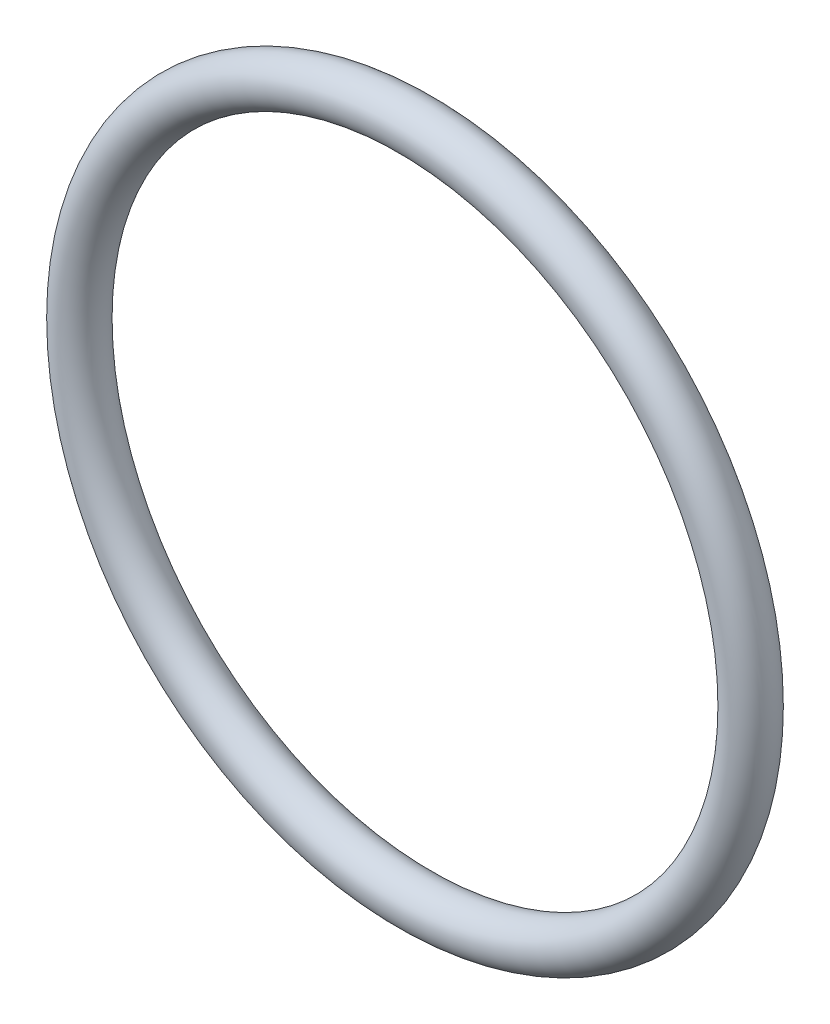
ISO-10303-21;
HEADER;
FILE_DESCRIPTION(('STEP AP214'),'2;1');
FILE_NAME('part.step','',(''),(''),'','','');
FILE_SCHEMA(('AUTOMOTIVE_DESIGN { 1 0 10303 214 1 1 1 1 }'));
ENDSEC;
DATA;
#1=APPLICATION_CONTEXT('core data for automotive mechanical design processes');
#2=APPLICATION_PROTOCOL_DEFINITION('international standard','automotive_design',2000,#1);
#3=PRODUCT_CONTEXT('',#1,'mechanical');
#4=PRODUCT('Part','Part','',(#3));
#5=PRODUCT_RELATED_PRODUCT_CATEGORY('part','',(#4));
#6=PRODUCT_DEFINITION_FORMATION('','',#4);
#7=PRODUCT_DEFINITION_CONTEXT('part definition',#1,'design');
#8=PRODUCT_DEFINITION('design','',#6,#7);
#9=PRODUCT_DEFINITION_SHAPE('','',#8);
#10=(LENGTH_UNIT() NAMED_UNIT(*) SI_UNIT(.MILLI.,.METRE.));
#11=(NAMED_UNIT(*) PLANE_ANGLE_UNIT() SI_UNIT($,.RADIAN.));
#12=(NAMED_UNIT(*) SI_UNIT($,.STERADIAN.) SOLID_ANGLE_UNIT());
#13=UNCERTAINTY_MEASURE_WITH_UNIT(LENGTH_MEASURE(1.E-05),#10,'distance_accuracy_value','');
#14=(GEOMETRIC_REPRESENTATION_CONTEXT(3) GLOBAL_UNCERTAINTY_ASSIGNED_CONTEXT((#13)) GLOBAL_UNIT_ASSIGNED_CONTEXT((#10,
#11,#12)) REPRESENTATION_CONTEXT('',''));
#15=CARTESIAN_POINT('',(0.,0.,0.));
#16=DIRECTION('',(0.,0.,1.));
#17=DIRECTION('',(1.,0.,0.));
#18=AXIS2_PLACEMENT_3D('',#15,#16,#17);
#19=CARTESIAN_POINT('',(0.,0.,0.));
#20=DIRECTION('',(0.,0.,1.));
#21=DIRECTION('',(1.,0.,0.));
#22=AXIS2_PLACEMENT_3D('',#19,#20,#21);
#23=TOROIDAL_SURFACE('',#22,14.5,1.);
#24=CARTESIAN_POINT('',(15.5,0.,0.));
#25=VERTEX_POINT('',#24);
#26=VERTEX_LOOP('',#25);
#27=FACE_BOUND('',#26,.T.);
#28=ADVANCED_FACE('F28',(#27),#23,.T.);
#29=CLOSED_SHELL('',(#28));
#30=MANIFOLD_SOLID_BREP('B2',#29);
#31=ADVANCED_BREP_SHAPE_REPRESENTATION('',(#18,#30),#14);
#32=SHAPE_DEFINITION_REPRESENTATION(#9,#31);
ENDSEC;
END-ISO-10303-21;
